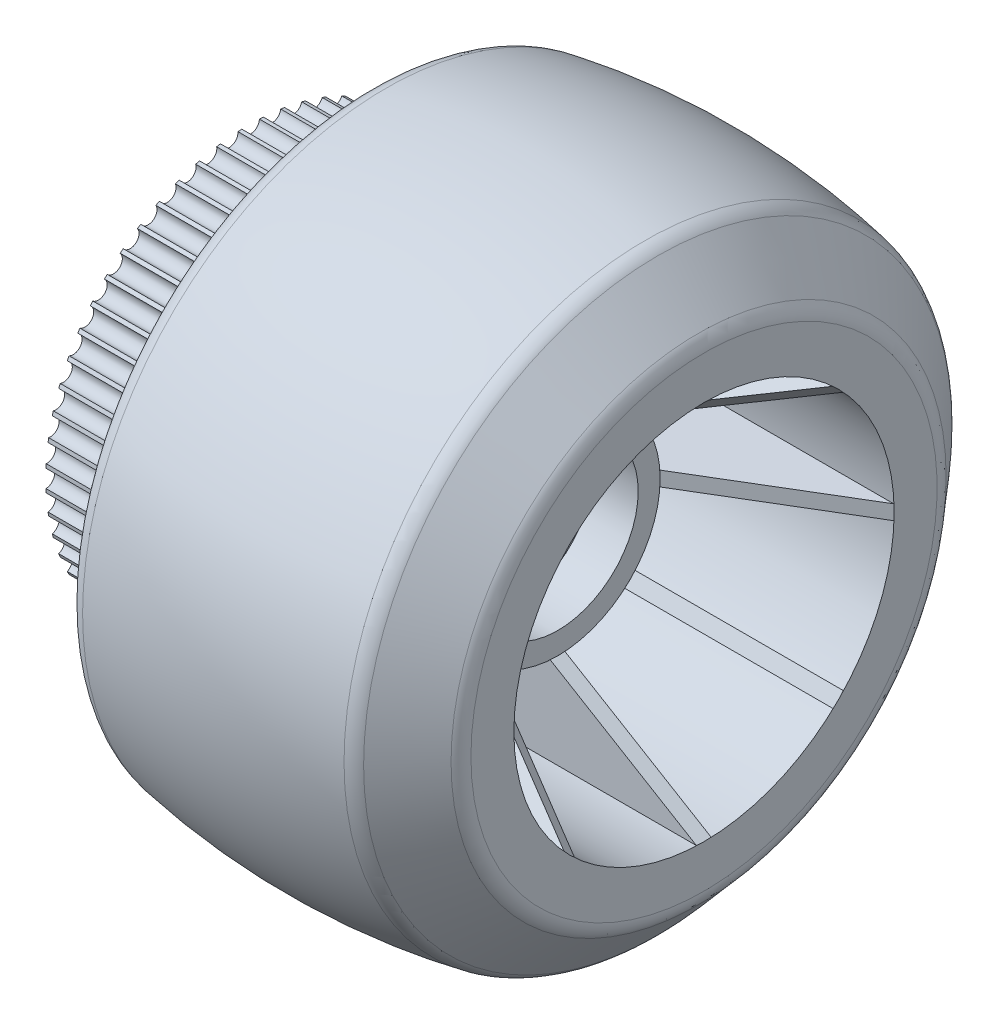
from build123d import *

# Parameters (mm, degrees)
CONG_1_R                     = 3
ESQUISSE2_R                  = 28
ENL_V_MAT_EXTRU_1_DEPTH      = 1.5
ESQUISSE3_R                  = 26
ENL_V_MAT_EXTRU_2_DEPTH      = 40
ESQUISSE4_R                  = 14
EXTRUSION1_DEPTH             = 20
NERVURE1_REACH               = 66.909
ESQUISSE5_WALL_W             = 155.142098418
ESQUISSE5_WALL_H             = 2
R_P_TITION_CIRCULAIRE1_COUNT = 8
ESQUISSE6_R                  = 11
ENL_V_MAT_EXTRU_3_DEPTH      = 6
ENL_V_START                  = -6
ESQUISSE7_R                  = 11
ENL_V_MAT_EXTRU_4_DEPTH      = 6
ESQUISSE8_R                  = 9.25
ENL_V_MAT_EXTRU_5_DEPTH      = 72.878001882
EXTRUSION2_START             = 17.5
ESQUISSE9_R                  = 28
EXTRUSION2_DEPTH             = 17.5
ENL_V_MAT_EXTRU_6_DEPTH      = 15
R_P_TITION_CIRCULAIRE2_COUNT = 60
ESQUISSE11_R                 = 23.25
ENL_V_MAT_EXTRU_7_DEPTH      = 17.5
ESQUISSE12_R                 = 19.5
ESQUISSE12_R_2               = 17
EXTRU_MINCE1_DEPTH           = 13.5
NERVURE2_REACH               = 85.954
ESQUISSE14_WALLS_W           = 2.5
ESQUISSE14_WALLS_H           = 173.657083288
R_P_TITION_CIRCULAIRE3_COUNT = 8
ESQUISSE15_R                 = 2.75
EXTRUSION3_DEPTH             = 13.5
ESQUISSE16_R                 = 1
ENL_V_MAT_EXTRU_8_DEPTH      = 13.5
R_P_TITION_CIRCULAIRE4_COUNT = 4


with BuildPart() as part:
    # Esquisse1 → R_volution2 (revolve)
    with BuildSketch(Plane.XY, mode=Mode.PRIVATE) as r_volution2_sk:
        with BuildLine():
            Line((-23, 0), (23, 0))
            Line((23, 0), (23, 33))
            Line((23, 33), (16, 41))
            ThreePointArc((16, 41), (-3.5, 42.919675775), (-23, 41))
            Line((-23, 41), (-23, 0))
        make_face()
    revolve(r_volution2_sk.sketch.rotate(Axis((-129.341829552, 0, 0), (1, 0, 0)), 90), axis=Axis((-129.341829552, 0, 0), (1, 0, 0)))

    # Cong_1
    cong_1_edges = [part.edges().sort_by_distance(p)[0] for p in [
        (-23, 0, -41),
        (16, 0, -41),
        (23, 0, -33),
    ]]
    fillet(cong_1_edges, radius=CONG_1_R)

    # Esquisse2 → Enl_v. mat.-Extru.1 (cut)
    with BuildSketch(Plane.ZY.offset(23)):
        Circle(ESQUISSE2_R)
    extrude(amount=-ENL_V_MAT_EXTRU_1_DEPTH, mode=Mode.SUBTRACT)

    # Esquisse3 → Enl_v. mat.-Extru.2 (cut)
    with BuildSketch(Plane(origin=(23, 0, 0), x_dir=(0, 0, -1), z_dir=(1, 0, 0))):
        Circle(ESQUISSE3_R)
    extrude(amount=-ENL_V_MAT_EXTRU_2_DEPTH, mode=Mode.SUBTRACT)

    # Esquisse4 → Extrusion1 (add)
    with BuildSketch(Plane(origin=(-17, 0, 0), x_dir=(0, 0, -1), z_dir=(1, 0, 0))):
        Circle(ESQUISSE4_R)
    extrude(amount=EXTRUSION1_DEPTH)

    # Esquisse5 wall → Nervure1 (add, up to next)
    with BuildSketch(Plane(origin=(13, 0, -20), x_dir=(0.857492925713, 0, -0.514495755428), z_dir=(-0.514495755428, 0, -0.857492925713)), mode=Mode.PRIVATE) as nervure1_sk1:
        Rectangle(ESQUISSE5_WALL_W, ESQUISSE5_WALL_H)
    nervure1_tool1 = extrude(nervure1_sk1.sketch, amount=NERVURE1_REACH, mode=Mode.PRIVATE) - part.part
    nervure1 = nervure1_tool1.solids().sort_by_distance((13, 0, -20))[0]
    add(nervure1)

    # R_p_tition circulaire1: Nervure1 ×8 about axis
    r_p_tition_circulaire1_axis = Axis((0, 0, 0), (1, 0, 0))
    for i in range(1, R_P_TITION_CIRCULAIRE1_COUNT):
        add(nervure1.rotate(r_p_tition_circulaire1_axis, i * 360 / R_P_TITION_CIRCULAIRE1_COUNT))

    # Esquisse6 → Enl_v. mat.-Extru.3 (cut)
    with BuildSketch(Plane(origin=(3, 0, 0), x_dir=(0, 0, -1), z_dir=(1, 0, 0))):
        Circle(ESQUISSE6_R)
    extrude(amount=-ENL_V_MAT_EXTRU_3_DEPTH, mode=Mode.SUBTRACT)

    # Esquisse7 → Enl_v. mat.-Extru.4 (cut)
    with BuildSketch(Plane.ZY.offset(21.5).offset(ENL_V_START)):
        with Locations(Location((0, 0, 0), (0, 0, 180))):
            Circle(ESQUISSE7_R)
    extrude(amount=ENL_V_MAT_EXTRU_4_DEPTH, mode=Mode.SUBTRACT)

    # Esquisse8 → Enl_v. mat.-Extru.5 (cut, through all)
    with BuildSketch(Plane.ZY.offset(15.5)):
        Circle(ESQUISSE8_R)
    extrude(amount=-ENL_V_MAT_EXTRU_5_DEPTH, mode=Mode.SUBTRACT)

    # Esquisse9 → Extrusion2 (add)
    with BuildSketch(Plane.ZY.offset(21.5).offset(EXTRUSION2_START)):
        Circle(ESQUISSE9_R)
    extrude(amount=-EXTRUSION2_DEPTH)

    # Esquisse10 → Enl_v. mat.-Extru.6 (cut)
    with BuildSketch(Plane.ZY.offset(39)):
        with BuildLine():
            Line((-1.2, 29.25), (1.2, 29.25))
            Line((1.2, 29.25), (1.2, 28))
            ThreePointArc((1.2, 28), (0, 26.8), (-1.2, 28))
            Line((-1.2, 28), (-1.2, 29.25))
        make_face()
    enl_v_mat_extru_6 = extrude(amount=-ENL_V_MAT_EXTRU_6_DEPTH, mode=Mode.SUBTRACT)

    # R_p_tition circulaire2: Enl_v. mat.-Extru.6 ×60 about axis
    r_p_tition_circulaire2_axis = Axis((0, 0, 0), (1, 0, 0))
    for i in range(1, R_P_TITION_CIRCULAIRE2_COUNT):
        add(enl_v_mat_extru_6.rotate(r_p_tition_circulaire2_axis, i * 360 / R_P_TITION_CIRCULAIRE2_COUNT), mode=Mode.SUBTRACT)

    # Esquisse11 → Enl_v. mat.-Extru.7 (cut)
    with BuildSketch(Plane.ZY.offset(39)):
        Circle(ESQUISSE11_R)
    extrude(amount=-ENL_V_MAT_EXTRU_7_DEPTH, mode=Mode.SUBTRACT)

    # Esquisse12 → Extru.-Mince1 (add)
    with BuildSketch(Plane.ZY.offset(21.5)):
        Circle(ESQUISSE12_R)
        Circle(ESQUISSE12_R_2, mode=Mode.SUBTRACT)
    extrude(amount=EXTRU_MINCE1_DEPTH)

    # Esquisse14 walls → Nervure2 (add, up to next)
    with BuildSketch(Plane.ZY.offset(35), mode=Mode.PRIVATE) as nervure2_sk1:
        with Locations((0, 21.375)):
            Rectangle(ESQUISSE14_WALLS_W, ESQUISSE14_WALLS_H)
    nervure2_tool1 = extrude(nervure2_sk1.sketch, amount=-NERVURE2_REACH, mode=Mode.PRIVATE) - part.part
    nervure2 = nervure2_tool1.solids().sort_by_distance((-35, 21.375, 0))[0]
    add(nervure2)

    # R_p_tition circulaire3: Nervure2 ×8 about axis
    r_p_tition_circulaire3_axis = Axis((3, 0, 0), (-1, 0, 0))
    for i in range(1, R_P_TITION_CIRCULAIRE3_COUNT):
        add(nervure2.rotate(r_p_tition_circulaire3_axis, i * 360 / R_P_TITION_CIRCULAIRE3_COUNT))

    # Esquisse15 → Extrusion3 (add)
    with BuildSketch(Plane.ZY.offset(35)):
        with Locations((7.462326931, 18.015650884)):
            Circle(ESQUISSE15_R)
    extrusion3 = extrude(amount=-EXTRUSION3_DEPTH)

    # Esquisse16 → Enl_v. mat.-Extru.8 (cut)
    with BuildSketch(Plane.ZY.offset(35)):
        with Locations((7.462326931, 18.015650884)):
            Circle(ESQUISSE16_R)
    enl_v_mat_extru_8 = extrude(amount=-ENL_V_MAT_EXTRU_8_DEPTH, mode=Mode.SUBTRACT)

    # R_p_tition circulaire4: Extrusion3, Enl_v. mat.-Extru.8 ×4 about axis
    r_p_tition_circulaire4_axis = Axis((0, 0, 0), (1, 0, 0))
    add([extrusion3.rotate(r_p_tition_circulaire4_axis, i * 360 / R_P_TITION_CIRCULAIRE4_COUNT) for i in range(1, R_P_TITION_CIRCULAIRE4_COUNT)])
    add([enl_v_mat_extru_8.rotate(r_p_tition_circulaire4_axis, i * 360 / R_P_TITION_CIRCULAIRE4_COUNT) for i in range(1, R_P_TITION_CIRCULAIRE4_COUNT)], mode=Mode.SUBTRACT)


solid = part.part
